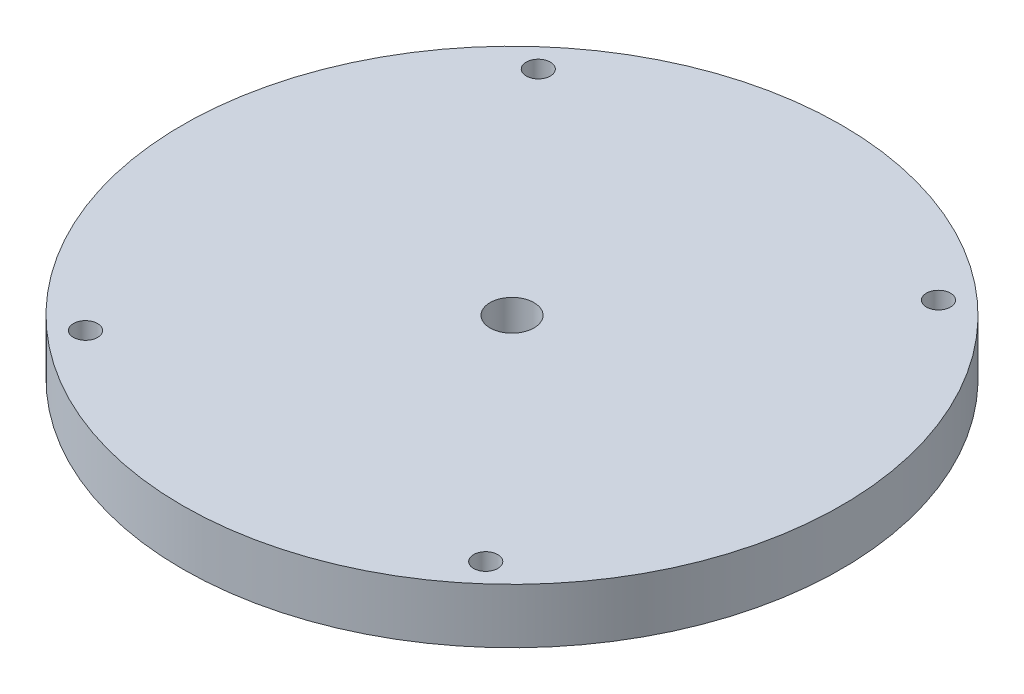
from build123d import *

# Parameters (mm, degrees)
SKETCH1_R           = 60
SKETCH1_R_2         = 4
SKETCH1_R_3         = 2.2
BOSS_EXTRUDE1_DEPTH = 10


with BuildPart() as part:
    # Sketch1 → Boss-Extrude1 (new body)
    with BuildSketch(Plane(origin=(0, 0, 0), x_dir=(1, 0, 0), z_dir=(0, 1, 0))):
        with Locations(Location((0, 0, 0), (0, 0, 270))):
            Circle(SKETCH1_R)
        with Locations(Location((0, 0, 0), (0, 0, 270))):
            Circle(SKETCH1_R_2, mode=Mode.SUBTRACT)
        with Locations(Location((-36.42965754, 41.218014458, 0), (0, 0, 270))):
            Circle(SKETCH1_R_3, mode=Mode.SUBTRACT)
        with Locations(Location((36.42965754, 41.218014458, 0), (0, 0, 270))):
            Circle(SKETCH1_R_3, mode=Mode.SUBTRACT)
        with Locations(Location((-36.42965754, -41.218014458, 0), (0, 0, 270))):
            Circle(SKETCH1_R_3, mode=Mode.SUBTRACT)
        with Locations(Location((36.42965754, -41.218014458, 0), (0, 0, 270))):
            Circle(SKETCH1_R_3, mode=Mode.SUBTRACT)
    extrude(amount=BOSS_EXTRUDE1_DEPTH)


solid = part.part
